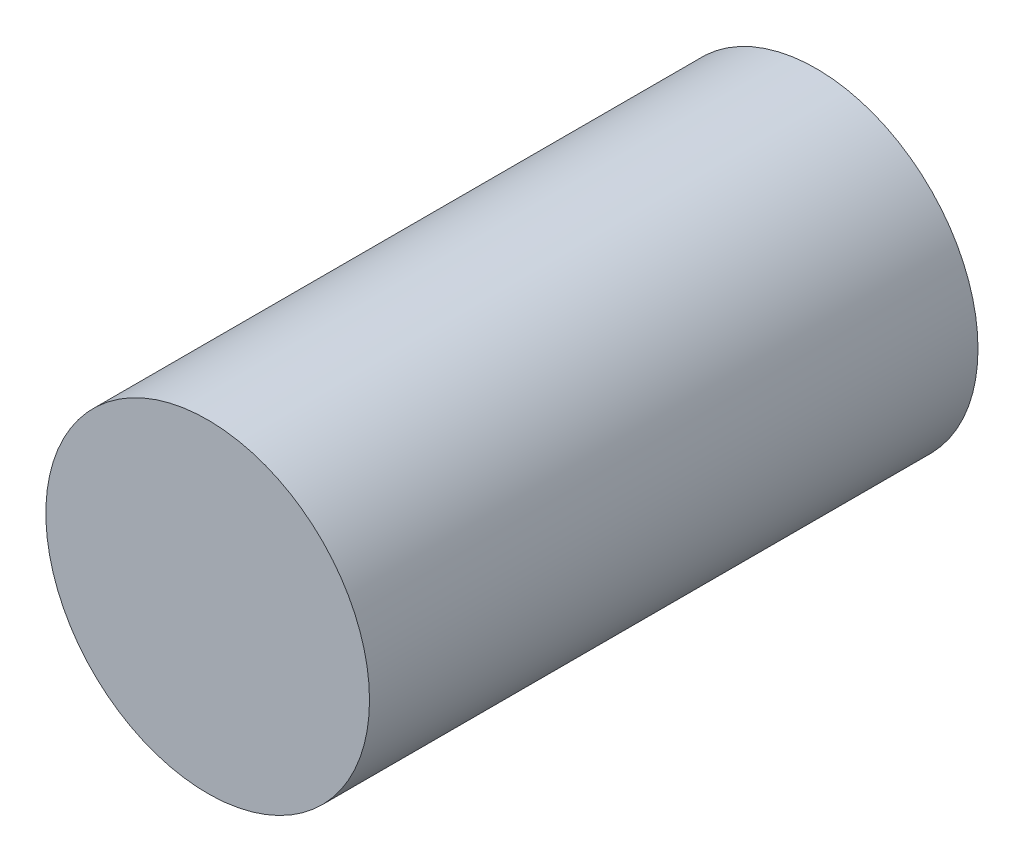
from build123d import *

# Parameters (mm, degrees)
SKETCH1_R           = 37.5
BOSS_EXTRUDE1_DEPTH = 141


with BuildPart() as part:
    # Sketch1 → Boss-Extrude1 (new body)
    with BuildSketch(Plane.XY):
        Circle(SKETCH1_R)
    extrude(amount=BOSS_EXTRUDE1_DEPTH)


solid = part.part
